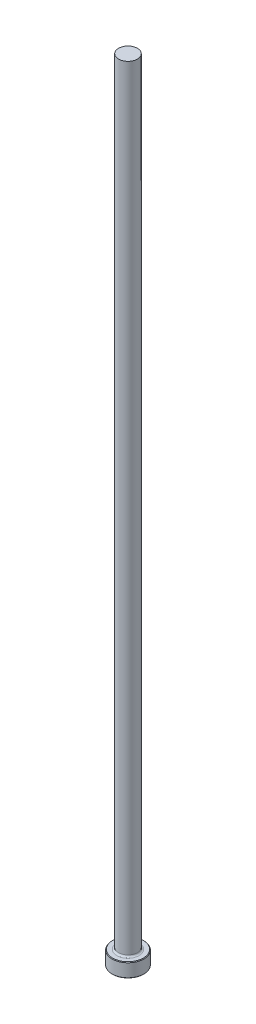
ISO-10303-21;
HEADER;
FILE_DESCRIPTION(('STEP AP214'),'2;1');
FILE_NAME('part.step','',(''),(''),'','','');
FILE_SCHEMA(('AUTOMOTIVE_DESIGN { 1 0 10303 214 1 1 1 1 }'));
ENDSEC;
DATA;
#1=APPLICATION_CONTEXT('core data for automotive mechanical design processes');
#2=APPLICATION_PROTOCOL_DEFINITION('international standard','automotive_design',2000,#1);
#3=PRODUCT_CONTEXT('',#1,'mechanical');
#4=PRODUCT('Part','Part','',(#3));
#5=PRODUCT_RELATED_PRODUCT_CATEGORY('part','',(#4));
#6=PRODUCT_DEFINITION_FORMATION('','',#4);
#7=PRODUCT_DEFINITION_CONTEXT('part definition',#1,'design');
#8=PRODUCT_DEFINITION('design','',#6,#7);
#9=PRODUCT_DEFINITION_SHAPE('','',#8);
#10=(LENGTH_UNIT() NAMED_UNIT(*) SI_UNIT(.MILLI.,.METRE.));
#11=(NAMED_UNIT(*) PLANE_ANGLE_UNIT() SI_UNIT($,.RADIAN.));
#12=(NAMED_UNIT(*) SI_UNIT($,.STERADIAN.) SOLID_ANGLE_UNIT());
#13=UNCERTAINTY_MEASURE_WITH_UNIT(LENGTH_MEASURE(1.E-05),#10,'distance_accuracy_value','');
#14=(GEOMETRIC_REPRESENTATION_CONTEXT(3) GLOBAL_UNCERTAINTY_ASSIGNED_CONTEXT((#13)) GLOBAL_UNIT_ASSIGNED_CONTEXT((#10,
#11,#12)) REPRESENTATION_CONTEXT('',''));
#15=CARTESIAN_POINT('',(0.,0.,0.));
#16=DIRECTION('',(0.,0.,1.));
#17=DIRECTION('',(1.,0.,0.));
#18=AXIS2_PLACEMENT_3D('',#15,#16,#17);
#19=CARTESIAN_POINT('',(0.,0.,0.));
#20=DIRECTION('',(0.,-1.,0.));
#21=DIRECTION('',(0.,0.,-1.));
#22=AXIS2_PLACEMENT_3D('',#19,#20,#21);
#23=PLANE('',#22);
#24=CARTESIAN_POINT('',(0.,0.,0.));
#25=DIRECTION('',(0.,-1.,0.));
#26=DIRECTION('',(0.,0.,-1.));
#27=AXIS2_PLACEMENT_3D('',#24,#25,#26);
#28=CIRCLE('',#27,6.88339999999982);
#29=CARTESIAN_POINT('',(0.,0.,-6.88339999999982));
#30=VERTEX_POINT('',#29);
#31=EDGE_CURVE('E41',#30,#30,#28,.T.);
#32=ORIENTED_EDGE('',*,*,#31,.T.);
#33=EDGE_LOOP('',(#32));
#34=FACE_BOUND('',#33,.T.);
#35=ADVANCED_FACE('F30',(#34),#23,.T.);
#36=CARTESIAN_POINT('',(0.,259.958771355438,0.));
#37=DIRECTION('',(0.,1.,0.));
#38=DIRECTION('',(0.,0.,1.));
#39=AXIS2_PLACEMENT_3D('',#36,#37,#38);
#40=CYLINDRICAL_SURFACE('',#39,7.13739999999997);
#41=CARTESIAN_POINT('',(0.,6.09599999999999,0.));
#42=DIRECTION('',(0.,1.,0.));
#43=DIRECTION('',(0.,0.,1.));
#44=AXIS2_PLACEMENT_3D('',#41,#42,#43);
#45=CIRCLE('',#44,7.13739999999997);
#46=CARTESIAN_POINT('',(0.,6.09599999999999,7.13739999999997));
#47=VERTEX_POINT('',#46);
#48=EDGE_CURVE('E45',#47,#47,#45,.F.);
#49=ORIENTED_EDGE('',*,*,#48,.T.);
#50=EDGE_LOOP('',(#49));
#51=FACE_BOUND('',#50,.T.);
#52=CARTESIAN_POINT('',(0.,0.254000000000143,0.));
#53=DIRECTION('',(0.,-1.,0.));
#54=DIRECTION('',(0.,0.,-1.));
#55=AXIS2_PLACEMENT_3D('',#52,#53,#54);
#56=CIRCLE('',#55,7.13739999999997);
#57=CARTESIAN_POINT('',(0.,0.254000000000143,-7.13739999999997));
#58=VERTEX_POINT('',#57);
#59=EDGE_CURVE('E50',#58,#58,#56,.F.);
#60=ORIENTED_EDGE('',*,*,#59,.T.);
#61=EDGE_LOOP('',(#60));
#62=FACE_BOUND('',#61,.T.);
#63=ADVANCED_FACE('F72',(#51,#62),#40,.T.);
#64=CARTESIAN_POINT('',(-7.13739999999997,6.35,0.));
#65=DIRECTION('',(0.,1.,0.));
#66=DIRECTION('',(0.,0.,1.));
#67=AXIS2_PLACEMENT_3D('',#64,#65,#66);
#68=PLANE('',#67);
#69=CARTESIAN_POINT('',(0.,6.35,0.));
#70=DIRECTION('',(0.,1.,0.));
#71=DIRECTION('',(0.,0.,1.));
#72=AXIS2_PLACEMENT_3D('',#69,#70,#71);
#73=CIRCLE('',#72,4.99236999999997);
#74=CARTESIAN_POINT('',(0.,6.35,4.99236999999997));
#75=VERTEX_POINT('',#74);
#76=EDGE_CURVE('E10',#75,#75,#73,.F.);
#77=ORIENTED_EDGE('',*,*,#76,.T.);
#78=EDGE_LOOP('',(#77));
#79=FACE_BOUND('',#78,.T.);
#80=CARTESIAN_POINT('',(0.,6.35,0.));
#81=DIRECTION('',(0.,1.,0.));
#82=DIRECTION('',(0.,0.,1.));
#83=AXIS2_PLACEMENT_3D('',#80,#81,#82);
#84=CIRCLE('',#83,6.88340000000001);
#85=CARTESIAN_POINT('',(0.,6.35,6.88340000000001));
#86=VERTEX_POINT('',#85);
#87=EDGE_CURVE('E53',#86,#86,#84,.T.);
#88=ORIENTED_EDGE('',*,*,#87,.T.);
#89=EDGE_LOOP('',(#88));
#90=FACE_BOUND('',#89,.T.);
#91=ADVANCED_FACE('F64',(#79,#90),#68,.T.);
#92=CARTESIAN_POINT('',(0.,259.958771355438,0.));
#93=DIRECTION('',(0.,1.,0.));
#94=DIRECTION('',(0.,0.,1.));
#95=AXIS2_PLACEMENT_3D('',#92,#93,#94);
#96=CYLINDRICAL_SURFACE('',#95,4.23036999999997);
#97=CARTESIAN_POINT('',(0.,7.11200000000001,0.));
#98=DIRECTION('',(0.,1.,0.));
#99=DIRECTION('',(0.,0.,1.));
#100=AXIS2_PLACEMENT_3D('',#97,#98,#99);
#101=CIRCLE('',#100,4.23036999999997);
#102=CARTESIAN_POINT('',(0.,7.11200000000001,4.23036999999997));
#103=VERTEX_POINT('',#102);
#104=EDGE_CURVE('E37',#103,#103,#101,.T.);
#105=ORIENTED_EDGE('',*,*,#104,.T.);
#106=EDGE_LOOP('',(#105));
#107=FACE_BOUND('',#106,.T.);
#108=CARTESIAN_POINT('',(0.,355.6,0.));
#109=DIRECTION('',(0.,1.,0.));
#110=DIRECTION('',(0.,0.,1.));
#111=AXIS2_PLACEMENT_3D('',#108,#109,#110);
#112=CIRCLE('',#111,4.23036999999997);
#113=CARTESIAN_POINT('',(0.,355.6,4.23036999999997));
#114=VERTEX_POINT('',#113);
#115=EDGE_CURVE('E56',#114,#114,#112,.T.);
#116=ORIENTED_EDGE('',*,*,#115,.F.);
#117=EDGE_LOOP('',(#116));
#118=FACE_BOUND('',#117,.T.);
#119=ADVANCED_FACE('F62',(#107,#118),#96,.T.);
#120=CARTESIAN_POINT('',(-4.23036999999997,355.6,0.));
#121=DIRECTION('',(0.,1.,0.));
#122=DIRECTION('',(0.,0.,1.));
#123=AXIS2_PLACEMENT_3D('',#120,#121,#122);
#124=PLANE('',#123);
#125=ORIENTED_EDGE('',*,*,#115,.T.);
#126=EDGE_LOOP('',(#125));
#127=FACE_BOUND('',#126,.T.);
#128=ADVANCED_FACE('F60',(#127),#124,.T.);
#129=CARTESIAN_POINT('',(0.,6.35000000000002,0.));
#130=DIRECTION('',(0.,-1.,0.));
#131=DIRECTION('',(0.,0.,-1.));
#132=AXIS2_PLACEMENT_3D('',#129,#130,#131);
#133=CONICAL_SURFACE('',#132,6.88339999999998,0.785398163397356);
#134=ORIENTED_EDGE('',*,*,#48,.F.);
#135=EDGE_LOOP('',(#134));
#136=FACE_BOUND('',#135,.T.);
#137=ORIENTED_EDGE('',*,*,#87,.F.);
#138=EDGE_LOOP('',(#137));
#139=FACE_BOUND('',#138,.T.);
#140=ADVANCED_FACE('F70',(#136,#139),#133,.T.);
#141=CARTESIAN_POINT('',(0.,0.254000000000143,0.));
#142=DIRECTION('',(0.,1.,0.));
#143=DIRECTION('',(0.,0.,1.));
#144=AXIS2_PLACEMENT_3D('',#141,#142,#143);
#145=CONICAL_SURFACE('',#144,7.13739999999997,0.785398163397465);
#146=ORIENTED_EDGE('',*,*,#31,.F.);
#147=EDGE_LOOP('',(#146));
#148=FACE_BOUND('',#147,.T.);
#149=ORIENTED_EDGE('',*,*,#59,.F.);
#150=EDGE_LOOP('',(#149));
#151=FACE_BOUND('',#150,.T.);
#152=ADVANCED_FACE('F84',(#148,#151),#145,.T.);
#153=CARTESIAN_POINT('',(0.,7.11200000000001,0.));
#154=DIRECTION('',(0.,1.,0.));
#155=DIRECTION('',(0.,0.,1.));
#156=AXIS2_PLACEMENT_3D('',#153,#154,#155);
#157=TOROIDAL_SURFACE('',#156,4.99236999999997,0.762);
#158=ORIENTED_EDGE('',*,*,#76,.F.);
#159=EDGE_LOOP('',(#158));
#160=FACE_BOUND('',#159,.T.);
#161=ORIENTED_EDGE('',*,*,#104,.F.);
#162=EDGE_LOOP('',(#161));
#163=FACE_BOUND('',#162,.T.);
#164=ADVANCED_FACE('F32',(#160,#163),#157,.F.);
#165=CLOSED_SHELL('',(#35,#63,#91,#119,#128,#140,#152,#164));
#166=MANIFOLD_SOLID_BREP('B2',#165);
#167=ADVANCED_BREP_SHAPE_REPRESENTATION('',(#18,#166),#14);
#168=SHAPE_DEFINITION_REPRESENTATION(#9,#167);
ENDSEC;
END-ISO-10303-21;
